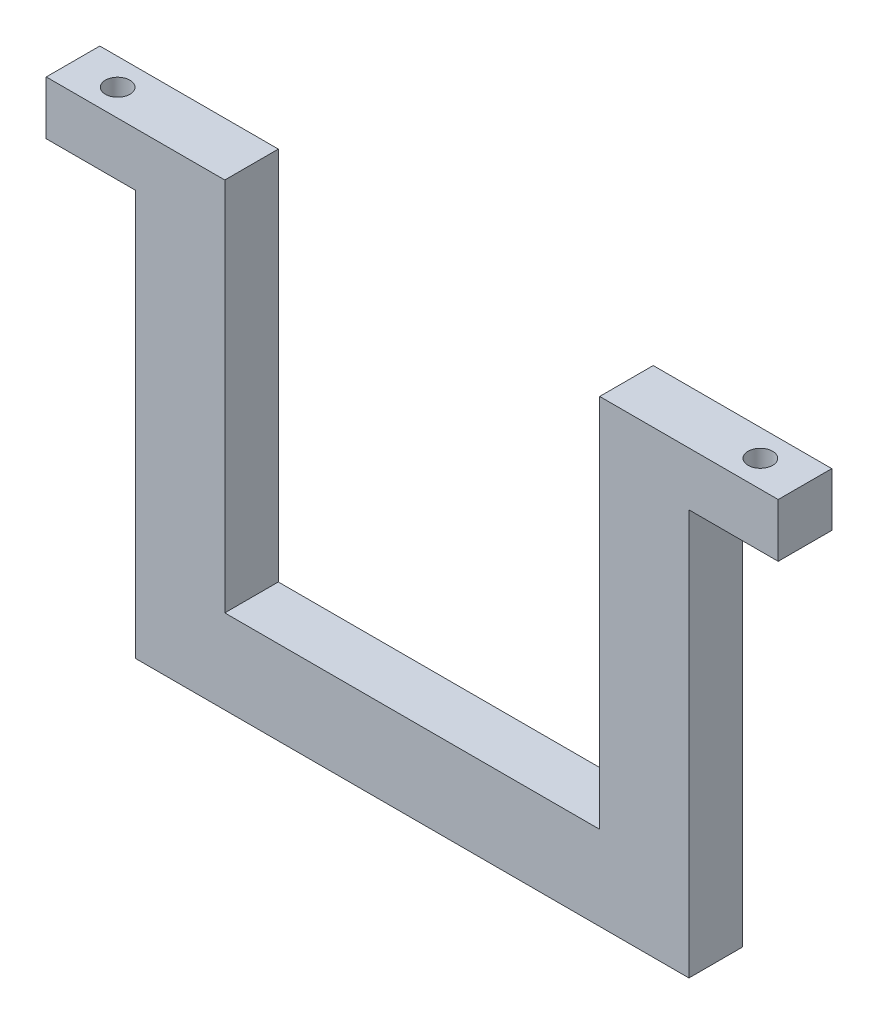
from build123d import *

# Parameters (mm, degrees)
BOSS_EXTRUDE1_DEPTH = 6
SKETCH2_W           = 6
SKETCH2_H           = 6
BOSS_EXTRUDE2_DEPTH = 10
SKETCH3_W           = 6
SKETCH3_H           = 6
BOSS_EXTRUDE3_DEPTH = 10
SKETCH4_R           = 1.375
CUT_EXTRUDE1_DEPTH  = 10


with BuildPart() as part:
    # Sketch1 → Boss-Extrude1 (new body)
    with BuildSketch(Plane.XY):
        Polygon((-50.227848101, 21), (-40.227848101, 21), (-40.227848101, -21), (1.772151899, -21), (1.772151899, 21), (11.772151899, 21), (11.772151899, -30.422463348), (-50.227848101, -30.422463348), align=None)
    extrude(amount=BOSS_EXTRUDE1_DEPTH)

    # Sketch2 → Boss-Extrude2 (add)
    with BuildSketch(Plane(origin=(11.772151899, 0, 0), x_dir=(0, 0, -1), z_dir=(1, 0, 0))):
        with Locations((-3, 18)):
            Rectangle(SKETCH2_W, SKETCH2_H)
    extrude(amount=BOSS_EXTRUDE2_DEPTH)

    # Sketch3 → Boss-Extrude3 (add)
    with BuildSketch(Plane.ZY.offset(50.227848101)):
        with Locations((3, 18)):
            Rectangle(SKETCH3_W, SKETCH3_H)
    extrude(amount=BOSS_EXTRUDE3_DEPTH)

    # Sketch4 → Cut-Extrude1 (cut)
    with BuildSketch(Plane.XZ.offset(-15)):
        with Locations((-55.227848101, 3)):
            Circle(SKETCH4_R)
        with Locations((16.772151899, 3)):
            Circle(SKETCH4_R)
    extrude(amount=-CUT_EXTRUDE1_DEPTH, mode=Mode.SUBTRACT)


solid = part.part
